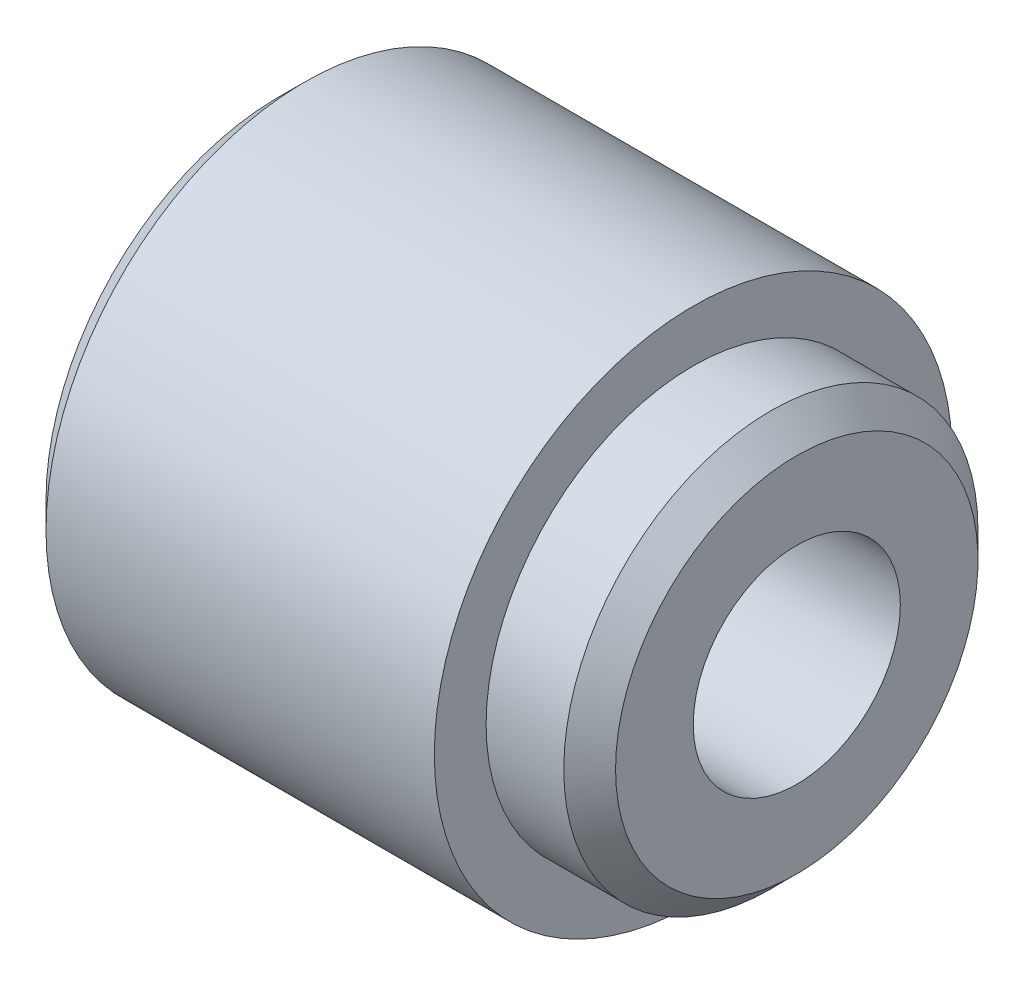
from build123d import *


with BuildPart() as part:
    # Esquisse1 → Base-R_volution (revolve)
    with BuildSketch(Plane.XY, mode=Mode.PRIVATE) as base_r_volution_sk:
        Polygon((-10, 9), (-9, 10), (6, 10), (6, 8), (9, 8), (10, 7), (10, 4), (-10, 4), align=None)
    revolve(base_r_volution_sk.sketch.rotate(Axis((0, 0, 0), (1, 0, 0)), 90), axis=Axis((0, 0, 0), (1, 0, 0)))


solid = part.part
